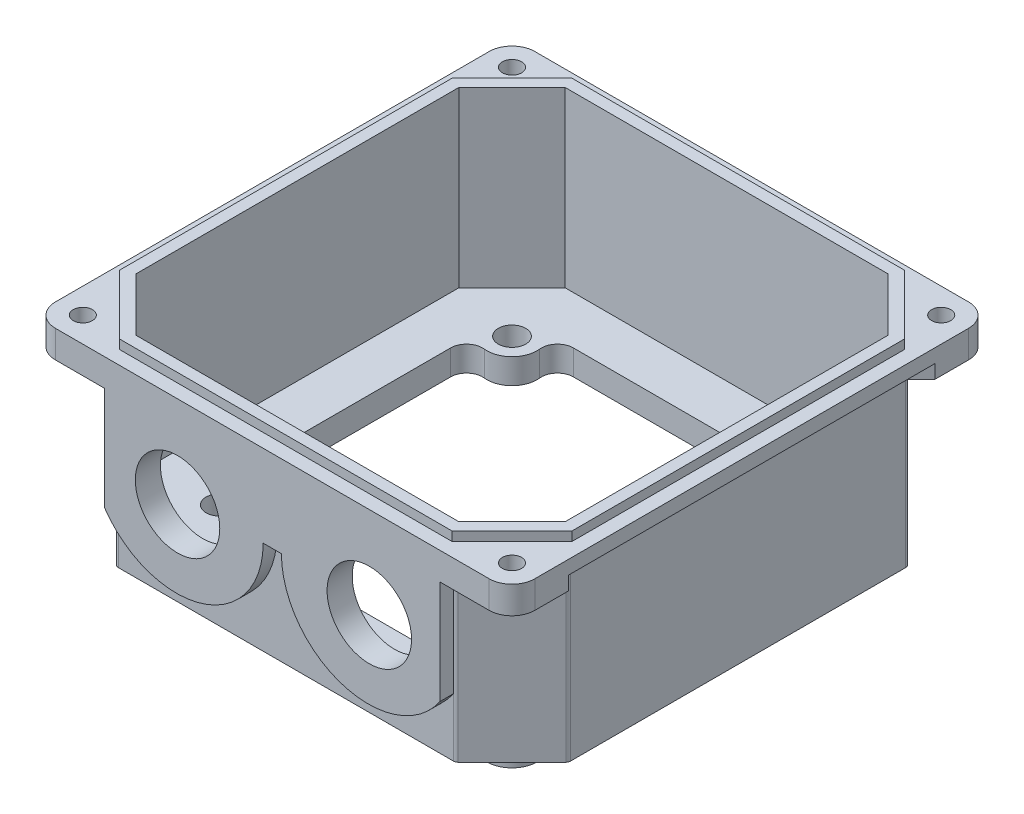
from build123d import *

# Parameters (mm, degrees)
SKETCH_1_W           = 105
SKETCH_1_H           = 105
EXTRUDE_1_DEPTH      = 38.5
EXTRUDE_2_DEPTH      = 2
SKETCH_3_R           = 3
CUT_EXTRUDE_1_DEPTH  = 84.634622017
CUT_EXTRUDE_2_DEPTH  = 85.573932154
SKETCH_5_W           = 105
SKETCH_5_H           = 105
EXTRUDE_3_DEPTH      = 3
SKETCH_6_OUTSIDE_W   = 137.946
SKETCH_6_OUTSIDE_H   = 137.946
SKETCH_6_OUTSIDE_W_2 = 99
SKETCH_6_OUTSIDE_H_2 = 99
CUT_EXTRUDE_3_DEPTH  = 38.5
EXTRUDE_4_DEPTH      = 3
CUT_EXTRUDE_4_DEPTH  = 36
EXTRUDE_5_DEPTH      = 2
FILLET_1_R           = 1
FILLET_2_R           = 1
FILLET_3_R           = 5
FILLET_4_R           = 5
EXTRUDE_6_DEPTH      = 3
SKETCH_15_W          = 3.414213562
SKETCH_15_H          = 3
EXTRUDE_7_DEPTH      = 3
M20X1_5_2_D          = 18.5
M20X1_5_2_DEPTH      = 44.5
M20X1_5_2_TIP        = 5.557960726


with BuildPart() as part:
    # Sketch 1 → Extrude 1 (new body)
    with BuildSketch(Plane(origin=(0, 0, 0), x_dir=(1, 0, 0), z_dir=(0, 1, 0))):
        Rectangle(SKETCH_1_W, SKETCH_1_H)
    extrude(amount=EXTRUDE_1_DEPTH)

    # Sketch 2 → Extrude 2 (add)
    with BuildSketch(Plane(origin=(0, 0, 0), x_dir=(-1, 0, 0), z_dir=(0, -1, 0))):
        with BuildLine():
            Line((38.5, 44), (-38.5, 44))
            ThreePointArc((-38.5, 44), (-42.389087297, 42.389087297), (-44, 38.5))
            Line((-44, 38.5), (-44, -38.5))
            ThreePointArc((-44, -38.5), (-42.389087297, -42.389087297), (-38.5, -44))
            Line((-38.5, -44), (38.5, -44))
            ThreePointArc((38.5, -44), (42.389087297, -42.389087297), (44, -38.5))
            Line((44, -38.5), (44, 38.5))
            ThreePointArc((44, 38.5), (42.389087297, 42.389087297), (38.5, 44))
        make_face()
        with BuildLine():
            Line((36, 41.5), (-36, 41.5))
            ThreePointArc((-36, 41.5), (-39.889087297, 39.889087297), (-41.5, 36))
            Line((-41.5, 36), (-41.5, -36))
            ThreePointArc((-41.5, -36), (-39.889087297, -39.889087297), (-36, -41.5))
            Line((-36, -41.5), (36, -41.5))
            ThreePointArc((36, -41.5), (39.889087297, -39.889087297), (41.5, -36))
            Line((41.5, -36), (41.5, 36))
            ThreePointArc((41.5, 36), (39.889087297, 39.889087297), (36, 41.5))
        make_face(mode=Mode.SUBTRACT)
    extrude(amount=EXTRUDE_2_DEPTH)

    # Sketch 3 → Cut-Extrude 1 (cut, through all)
    with BuildSketch(Plane(origin=(0, 0, 0), x_dir=(-1, 0, 0), z_dir=(0, -1, 0))):
        with Locations(Location((-32, -32, 0), (0, 0, 90))):
            Circle(SKETCH_3_R)
        with Locations(Location((-32, 32, 0), (0, 0, 90))):
            Circle(SKETCH_3_R)
        with Locations(Location((32, 32, 0), (0, 0, 90))):
            Circle(SKETCH_3_R)
        with Locations(Location((32, -32, 0), (0, 0, 90))):
            Circle(SKETCH_3_R)
        with BuildLine():
            Line((36.5, 23.05572809), (36.5, -23.05572809))
            ThreePointArc((36.5, -23.05572809), (35.333333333, -25.664474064), (32.611111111, -26.534056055))
            ThreePointArc((32.611111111, -26.534056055), (28.110912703, -28.110912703), (26.534056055, -32.611111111))
            ThreePointArc((26.534056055, -32.611111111), (25.664474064, -35.333333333), (23.05572809, -36.5))
            Line((23.05572809, -36.5), (-23.05572809, -36.5))
            ThreePointArc((-23.05572809, -36.5), (-25.664474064, -35.333333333), (-26.534056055, -32.611111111))
            ThreePointArc((-26.534056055, -32.611111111), (-28.110912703, -28.110912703), (-32.611111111, -26.534056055))
            ThreePointArc((-32.611111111, -26.534056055), (-35.333333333, -25.664474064), (-36.5, -23.05572809))
            Line((-36.5, -23.05572809), (-36.5, 23.05572809))
            ThreePointArc((-36.5, 23.05572809), (-35.333333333, 25.664474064), (-32.611111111, 26.534056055))
            ThreePointArc((-32.611111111, 26.534056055), (-28.110912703, 28.110912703), (-26.534056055, 32.611111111))
            ThreePointArc((-26.534056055, 32.611111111), (-25.664474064, 35.333333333), (-23.05572809, 36.5))
            Line((-23.05572809, 36.5), (23.05572809, 36.5))
            ThreePointArc((23.05572809, 36.5), (25.664474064, 35.333333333), (26.534056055, 32.611111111))
            ThreePointArc((26.534056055, 32.611111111), (28.110912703, 28.110912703), (32.611111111, 26.534056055))
            ThreePointArc((32.611111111, 26.534056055), (35.333333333, 25.664474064), (36.5, 23.05572809))
        make_face()
    extrude(amount=-CUT_EXTRUDE_1_DEPTH, mode=Mode.SUBTRACT)

    # Sketch 4 → Cut-Extrude 2 (cut, through all)
    with BuildSketch(Plane(origin=(0, 38.5, 0), x_dir=(1, 0, 0), z_dir=(0, 1, 0))):
        Polygon((52.5, 52.5), (52.5, 34.120580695), (34.120580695, 52.5), align=None)
        Polygon((52.5, -52.5), (34.120580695, -52.5), (52.5, -34.120580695), align=None)
        Polygon((-52.5, -52.5), (-52.5, -34.120580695), (-34.120580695, -52.5), align=None)
        Polygon((-52.5, 52.5), (-34.120580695, 52.5), (-52.5, 34.120580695), align=None)
    extrude(amount=-CUT_EXTRUDE_2_DEPTH, mode=Mode.SUBTRACT)

    # Sketch 5 → Extrude 3 (add)
    with BuildSketch(Plane(origin=(0, 38.5, 0), x_dir=(1, 0, 0), z_dir=(0, 1, 0))):
        Rectangle(SKETCH_5_W, SKETCH_5_H)
    extrude(amount=EXTRUDE_3_DEPTH)

    # Sketch 6 outside → Cut-Extrude 3 (cut)
    with BuildSketch(Plane.XZ):
        Rectangle(SKETCH_6_OUTSIDE_W, SKETCH_6_OUTSIDE_H)
        Rectangle(SKETCH_6_OUTSIDE_W_2, SKETCH_6_OUTSIDE_H_2, mode=Mode.SUBTRACT)
    extrude(amount=-CUT_EXTRUDE_3_DEPTH, mode=Mode.SUBTRACT)

    # Sketch 7 → Extrude 4 (add)
    with BuildSketch(Plane.XZ.offset(-38.5)):
        Polygon((37.120580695, 49.5), (40.120580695, 52.5), (52.5, 52.5), (52.5, 40.120580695), (49.5, 37.120580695), align=None)
        Polygon((37.120580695, -49.5), (49.5, -37.120580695), (52.5, -40.120580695), (52.5, -52.5), (40.120580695, -52.5), align=None)
        Polygon((-49.5, -37.120580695), (-37.120580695, -49.5), (-40.120580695, -52.5), (-52.5, -52.5), (-52.5, -40.120580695), align=None)
        Polygon((-37.120580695, 49.5), (-49.5, 37.120580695), (-52.5, 40.120580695), (-52.5, 52.5), (-40.120580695, 52.5), align=None)
    extrude(amount=EXTRUDE_4_DEPTH)

    # Sketch 8 → Cut-Extrude 4 (cut)
    with BuildSketch(Plane(origin=(0, 41.5, 0), x_dir=(1, 0, 0), z_dir=(0, 1, 0))):
        Polygon((-35.377940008, -47), (35.377940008, -47), (47, -35.377940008), (47, 35.377940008), (35.377940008, 47), (-35.377940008, 47), (-47, 35.377940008), (-47, -35.377940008), align=None)
    extrude(amount=-CUT_EXTRUDE_4_DEPTH, mode=Mode.SUBTRACT)

    # Sketch 9 → Extrude 5 (add)
    with BuildSketch(Plane(origin=(0, 41.5, 0), x_dir=(1, 0, 0), z_dir=(0, 1, 0))):
        Polygon((49.5, 36.413473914), (36.413473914, 49.5), (-36.413473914, 49.5), (-49.5, 36.413473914), (-49.5, -36.413473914), (-36.413473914, -49.5), (36.413473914, -49.5), (49.5, -36.413473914), align=None)
        Polygon((35.377940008, -47), (47, -35.377940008), (47, 35.377940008), (35.377940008, 47), (-35.377940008, 47), (-47, 35.377940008), (-47, -35.377940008), (-35.377940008, -47), align=None, mode=Mode.SUBTRACT)
    extrude(amount=EXTRUDE_5_DEPTH)

    # Sketch 12 → Hole Wizard M5 _1 (revolve, cut)
    with BuildSketch(Plane(origin=(47, 41.5, -47), x_dir=(0, 0, 1), z_dir=(1, 0, 0))):
        Polygon((0, 0), (0, 13.6618073), (2.1, 12.4), (2.1, 0), align=None)
    hole_wizard_m5_1 = revolve(axis=Axis((47, 47.85, -47), (0, -1, 0)), mode=Mode.SUBTRACT)

    # Mirror 1: Hole Wizard M5 _1 across plane
    add(hole_wizard_m5_1.mirror(Plane.XY), mode=Mode.SUBTRACT)

    # Mirror 2: Hole Wizard M5 _1 across plane
    add(hole_wizard_m5_1.mirror(Plane(origin=(0, 0, 0), x_dir=(0, 0, 1), z_dir=(1, 0, 0))), mode=Mode.SUBTRACT)

    # Mirror 2 copy 1 sketch → Mirror 2 copy 1 (revolve, cut)
    with BuildSketch(Plane(origin=(-47, 41.5, 47), x_dir=(0, 0, -1), z_dir=(-1, 0, 0))):
        Polygon((0, 0), (0, 13.6618073), (2.1, 12.4), (2.1, 0), align=None)
    revolve(axis=Axis((-47, 47.85, 47), (0, -1, 0)), mode=Mode.SUBTRACT)

    # Fillet 1
    fillet_1_edges = [part.edges().sort_by_distance(p)[0] for p in [
        (49.5, 17.75, -37.120580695),
        (37.120580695, 17.75, 49.5),
        (-49.5, 17.75, 37.120580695),
        (49.5, 17.75, 37.120580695),
        (37.120580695, 17.75, -49.5),
        (-37.120580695, 17.75, 49.5),
    ]]
    fillet(fillet_1_edges, radius=FILLET_1_R)

    # Fillet 2
    fillet_2_edges = [part.edges().sort_by_distance(p)[0] for p in [
        (-37.120580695, 17.75, -49.5),
        (-49.5, 17.75, -37.120580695),
    ]]
    fillet(fillet_2_edges, radius=FILLET_2_R)

    # Fillet 3
    fillet_3_edges = [part.edges().sort_by_distance(p)[0] for p in [
        (-52.5, 38.5, 52.5),
    ]]
    fillet(fillet_3_edges, radius=FILLET_3_R)

    # Fillet 4
    fillet_4_edges = [part.edges().sort_by_distance(p)[0] for p in [
        (-52.5, 38.5, -52.5),
        (52.5, 38.5, 52.5),
        (52.5, 38.5, -52.5),
    ]]
    fillet(fillet_4_edges, radius=FILLET_4_R)

    # Sketch 14 → Extrude 6 (add)
    with BuildSketch(Plane.XY.offset(49.5)):
        with BuildLine():
            Line((-2, 23.5), (2, 23.5))
            ThreePointArc((2, 23.5), (15.406297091, 5.342068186), (36.706367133, 12.808413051))
            Line((36.706367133, 12.808413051), (36.706367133, 41.5))
            Line((36.706367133, 41.5), (-36.706367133, 41.5))
            Line((-36.706367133, 41.5), (-36.706367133, 12.808413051))
            ThreePointArc((-36.706367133, 12.808413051), (-15.406297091, 5.342068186), (-2, 23.5))
        make_face()
    extrude(amount=EXTRUDE_6_DEPTH)

    # Sketch 15 → Extrude 7 (add)
    with BuildSketch(Plane.XY.offset(52.5)):
        with Locations((-38.413473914, 37)):
            Rectangle(SKETCH_15_W, SKETCH_15_H)
        with Locations((38.413473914, 37)):
            Rectangle(SKETCH_15_W, SKETCH_15_H)
    extrude(amount=-EXTRUDE_7_DEPTH)

    # M20x1.5 _2
    with Locations(Plane.XY.offset(52.5)):
        with Locations((-20.75128136, 21.5), (21.24871864, 21.5)):
            Hole(M20X1_5_2_D / 2, depth=M20X1_5_2_DEPTH)
            with Locations((0, 0, -(M20X1_5_2_DEPTH + M20X1_5_2_TIP / 2))):  # 118° drill point
                Cone(0, M20X1_5_2_D / 2, M20X1_5_2_TIP, mode=Mode.SUBTRACT)


solid = part.part
